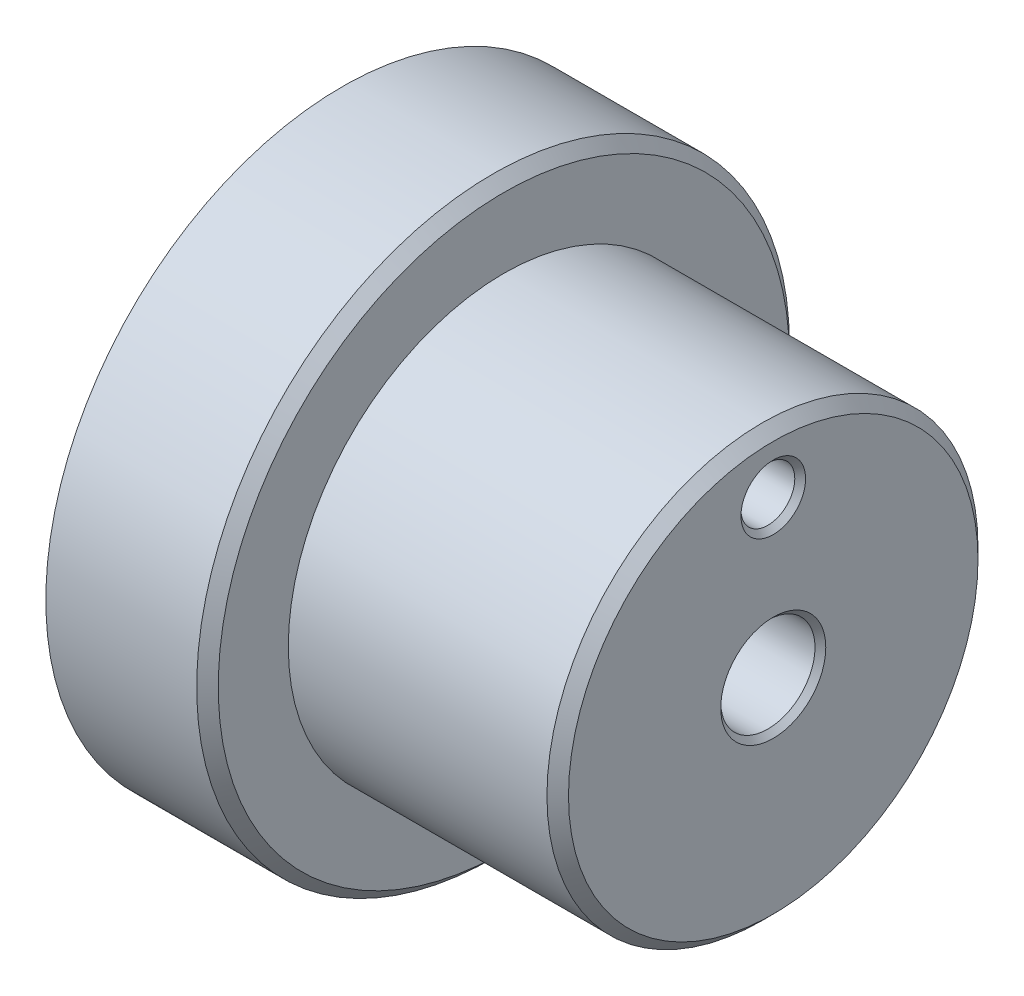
ISO-10303-21;
HEADER;
FILE_DESCRIPTION(('STEP AP214'),'2;1');
FILE_NAME('part.step','',(''),(''),'','','');
FILE_SCHEMA(('AUTOMOTIVE_DESIGN { 1 0 10303 214 1 1 1 1 }'));
ENDSEC;
DATA;
#1=APPLICATION_CONTEXT('core data for automotive mechanical design processes');
#2=APPLICATION_PROTOCOL_DEFINITION('international standard','automotive_design',2000,#1);
#3=PRODUCT_CONTEXT('',#1,'mechanical');
#4=PRODUCT('Part','Part','',(#3));
#5=PRODUCT_RELATED_PRODUCT_CATEGORY('part','',(#4));
#6=PRODUCT_DEFINITION_FORMATION('','',#4);
#7=PRODUCT_DEFINITION_CONTEXT('part definition',#1,'design');
#8=PRODUCT_DEFINITION('design','',#6,#7);
#9=PRODUCT_DEFINITION_SHAPE('','',#8);
#10=(LENGTH_UNIT() NAMED_UNIT(*) SI_UNIT(.MILLI.,.METRE.));
#11=(NAMED_UNIT(*) PLANE_ANGLE_UNIT() SI_UNIT($,.RADIAN.));
#12=(NAMED_UNIT(*) SI_UNIT($,.STERADIAN.) SOLID_ANGLE_UNIT());
#13=UNCERTAINTY_MEASURE_WITH_UNIT(LENGTH_MEASURE(1.E-05),#10,'distance_accuracy_value','');
#14=(GEOMETRIC_REPRESENTATION_CONTEXT(3) GLOBAL_UNCERTAINTY_ASSIGNED_CONTEXT((#13)) GLOBAL_UNIT_ASSIGNED_CONTEXT((#10,
#11,#12)) REPRESENTATION_CONTEXT('',''));
#15=CARTESIAN_POINT('',(0.,0.,0.));
#16=DIRECTION('',(0.,0.,1.));
#17=DIRECTION('',(1.,0.,0.));
#18=AXIS2_PLACEMENT_3D('',#15,#16,#17);
#19=CARTESIAN_POINT('',(0.,0.,0.));
#20=DIRECTION('',(1.,0.,0.));
#21=DIRECTION('',(0.,0.,-1.));
#22=AXIS2_PLACEMENT_3D('',#19,#20,#21);
#23=CYLINDRICAL_SURFACE('',#22,55.);
#24=CARTESIAN_POINT('',(-19.2933837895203,0.,0.));
#25=DIRECTION('',(1.,0.,0.));
#26=DIRECTION('',(0.,0.,-1.));
#27=AXIS2_PLACEMENT_3D('',#24,#25,#26);
#28=CIRCLE('',#27,55.);
#29=CARTESIAN_POINT('',(-19.2933837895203,0.,-55.));
#30=VERTEX_POINT('',#29);
#31=EDGE_CURVE('E140',#30,#30,#28,.F.);
#32=ORIENTED_EDGE('',*,*,#31,.T.);
#33=EDGE_LOOP('',(#32));
#34=FACE_BOUND('',#33,.T.);
#35=CARTESIAN_POINT('',(-47.2933837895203,0.,0.));
#36=DIRECTION('',(1.,0.,0.));
#37=DIRECTION('',(0.,0.,-1.));
#38=AXIS2_PLACEMENT_3D('',#35,#36,#37);
#39=CIRCLE('',#38,55.);
#40=CARTESIAN_POINT('',(-47.2933837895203,0.,-55.));
#41=VERTEX_POINT('',#40);
#42=EDGE_CURVE('E134',#41,#41,#39,.T.);
#43=ORIENTED_EDGE('',*,*,#42,.T.);
#44=EDGE_LOOP('',(#43));
#45=FACE_BOUND('',#44,.T.);
#46=ADVANCED_FACE('F40',(#34,#45),#23,.T.);
#47=CARTESIAN_POINT('',(-47.2933837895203,55.,0.));
#48=DIRECTION('',(-1.,0.,0.));
#49=DIRECTION('',(0.,0.,1.));
#50=AXIS2_PLACEMENT_3D('',#47,#48,#49);
#51=PLANE('',#50);
#52=CARTESIAN_POINT('',(-47.2933837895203,0.,0.));
#53=DIRECTION('',(-1.,0.,0.));
#54=DIRECTION('',(0.,0.,1.));
#55=AXIS2_PLACEMENT_3D('',#52,#53,#54);
#56=CIRCLE('',#55,46.);
#57=CARTESIAN_POINT('',(-47.2933837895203,0.,46.));
#58=VERTEX_POINT('',#57);
#59=EDGE_CURVE('E149',#58,#58,#56,.F.);
#60=ORIENTED_EDGE('',*,*,#59,.T.);
#61=EDGE_LOOP('',(#60));
#62=FACE_BOUND('',#61,.T.);
#63=ORIENTED_EDGE('',*,*,#42,.F.);
#64=EDGE_LOOP('',(#63));
#65=FACE_BOUND('',#64,.T.);
#66=ADVANCED_FACE('F221',(#62,#65),#51,.T.);
#67=CARTESIAN_POINT('',(0.,0.,0.));
#68=DIRECTION('',(1.,0.,0.));
#69=DIRECTION('',(0.,0.,-1.));
#70=AXIS2_PLACEMENT_3D('',#67,#68,#69);
#71=CYLINDRICAL_SURFACE('',#70,45.);
#72=CARTESIAN_POINT('',(-38.2933837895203,0.,0.));
#73=DIRECTION('',(-1.,0.,0.));
#74=DIRECTION('',(0.,0.,1.));
#75=AXIS2_PLACEMENT_3D('',#72,#73,#74);
#76=CIRCLE('',#75,45.);
#77=CARTESIAN_POINT('',(-38.2933837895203,0.,45.));
#78=VERTEX_POINT('',#77);
#79=EDGE_CURVE('E155',#78,#78,#76,.F.);
#80=ORIENTED_EDGE('',*,*,#79,.T.);
#81=EDGE_LOOP('',(#80));
#82=FACE_BOUND('',#81,.T.);
#83=CARTESIAN_POINT('',(-46.2933837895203,0.,0.));
#84=DIRECTION('',(-1.,0.,0.));
#85=DIRECTION('',(0.,0.,1.));
#86=AXIS2_PLACEMENT_3D('',#83,#84,#85);
#87=CIRCLE('',#86,45.);
#88=CARTESIAN_POINT('',(-46.2933837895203,0.,45.));
#89=VERTEX_POINT('',#88);
#90=EDGE_CURVE('E152',#89,#89,#87,.T.);
#91=ORIENTED_EDGE('',*,*,#90,.T.);
#92=EDGE_LOOP('',(#91));
#93=FACE_BOUND('',#92,.T.);
#94=ADVANCED_FACE('F227',(#82,#93),#71,.F.);
#95=CARTESIAN_POINT('',(-37.2933837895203,45.,0.));
#96=DIRECTION('',(-1.,0.,0.));
#97=DIRECTION('',(0.,0.,1.));
#98=AXIS2_PLACEMENT_3D('',#95,#96,#97);
#99=PLANE('',#98);
#100=CARTESIAN_POINT('',(-37.2933837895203,0.,0.));
#101=DIRECTION('',(-1.,0.,0.));
#102=DIRECTION('',(0.,0.,1.));
#103=AXIS2_PLACEMENT_3D('',#100,#101,#102);
#104=CIRCLE('',#103,9.75000000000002);
#105=CARTESIAN_POINT('',(-37.2933837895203,0.,9.75000000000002));
#106=VERTEX_POINT('',#105);
#107=EDGE_CURVE('E167',#106,#106,#104,.F.);
#108=ORIENTED_EDGE('',*,*,#107,.T.);
#109=EDGE_LOOP('',(#108));
#110=FACE_BOUND('',#109,.T.);
#111=CARTESIAN_POINT('',(-37.2933837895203,0.,0.));
#112=DIRECTION('',(-1.,0.,0.));
#113=DIRECTION('',(0.,0.,1.));
#114=AXIS2_PLACEMENT_3D('',#111,#112,#113);
#115=CIRCLE('',#114,44.);
#116=CARTESIAN_POINT('',(-37.2933837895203,0.,44.));
#117=VERTEX_POINT('',#116);
#118=EDGE_CURVE('E158',#117,#117,#115,.T.);
#119=ORIENTED_EDGE('',*,*,#118,.T.);
#120=EDGE_LOOP('',(#119));
#121=FACE_BOUND('',#120,.T.);
#122=ADVANCED_FACE('F264',(#110,#121),#99,.T.);
#123=CARTESIAN_POINT('',(32.7066162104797,0.,0.));
#124=DIRECTION('',(1.,0.,0.));
#125=DIRECTION('',(0.,0.,-1.));
#126=AXIS2_PLACEMENT_3D('',#123,#124,#125);
#127=PLANE('',#126);
#128=CARTESIAN_POINT('',(32.7066162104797,29.,0.));
#129=DIRECTION('',(1.,0.,0.));
#130=DIRECTION('',(0.,0.,-1.));
#131=AXIS2_PLACEMENT_3D('',#128,#129,#130);
#132=CIRCLE('',#131,5.99999999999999);
#133=CARTESIAN_POINT('',(32.7066162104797,29.,-5.99999999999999));
#134=VERTEX_POINT('',#133);
#135=EDGE_CURVE('E11',#134,#134,#132,.F.);
#136=ORIENTED_EDGE('',*,*,#135,.T.);
#137=EDGE_LOOP('',(#136));
#138=FACE_BOUND('',#137,.T.);
#139=CARTESIAN_POINT('',(32.7066162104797,0.,0.));
#140=DIRECTION('',(1.,0.,0.));
#141=DIRECTION('',(0.,0.,-1.));
#142=AXIS2_PLACEMENT_3D('',#139,#140,#141);
#143=CIRCLE('',#142,9.74999999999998);
#144=CARTESIAN_POINT('',(32.7066162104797,0.,-9.74999999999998));
#145=VERTEX_POINT('',#144);
#146=EDGE_CURVE('E170',#145,#145,#143,.F.);
#147=ORIENTED_EDGE('',*,*,#146,.T.);
#148=EDGE_LOOP('',(#147));
#149=FACE_BOUND('',#148,.T.);
#150=CARTESIAN_POINT('',(32.7066162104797,0.,0.));
#151=DIRECTION('',(1.,0.,0.));
#152=DIRECTION('',(0.,0.,-1.));
#153=AXIS2_PLACEMENT_3D('',#150,#151,#152);
#154=CIRCLE('',#153,38.);
#155=CARTESIAN_POINT('',(32.7066162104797,0.,-38.));
#156=VERTEX_POINT('',#155);
#157=EDGE_CURVE('E143',#156,#156,#154,.T.);
#158=ORIENTED_EDGE('',*,*,#157,.T.);
#159=EDGE_LOOP('',(#158));
#160=FACE_BOUND('',#159,.T.);
#161=ADVANCED_FACE('F261',(#138,#149,#160),#127,.T.);
#162=CARTESIAN_POINT('',(0.,0.,0.));
#163=DIRECTION('',(1.,0.,0.));
#164=DIRECTION('',(0.,0.,-1.));
#165=AXIS2_PLACEMENT_3D('',#162,#163,#164);
#166=CYLINDRICAL_SURFACE('',#165,40.);
#167=CARTESIAN_POINT('',(-5.29338378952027,-39.1918358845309,8.));
#168=CARTESIAN_POINT('',(-5.51598431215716,-39.1918159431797,8.00002666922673));
#169=CARTESIAN_POINT('',(-5.73857793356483,-39.1937316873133,7.99071035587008));
#170=CARTESIAN_POINT('',(-6.18212753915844,-39.2012897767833,7.95358673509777));
#171=CARTESIAN_POINT('',(-6.40308372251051,-39.2069316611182,7.92578171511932));
#172=CARTESIAN_POINT('',(-6.84145708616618,-39.2217860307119,7.85193172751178));
#173=CARTESIAN_POINT('',(-7.05887913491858,-39.2309930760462,7.80591454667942));
#174=CARTESIAN_POINT('',(-7.48898923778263,-39.2527015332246,7.69601051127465));
#175=CARTESIAN_POINT('',(-7.70167727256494,-39.2652029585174,7.63212358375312));
#176=CARTESIAN_POINT('',(-8.12081652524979,-39.2931373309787,7.48697595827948));
#177=CARTESIAN_POINT('',(-8.32726832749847,-39.3085700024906,7.40571689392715));
#178=CARTESIAN_POINT('',(-8.73262031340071,-39.3419309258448,7.22639517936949));
#179=CARTESIAN_POINT('',(-8.93151766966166,-39.359860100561,7.12832631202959));
#180=CARTESIAN_POINT('',(-9.32029083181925,-39.3976973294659,6.91614404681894));
#181=CARTESIAN_POINT('',(-9.51016909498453,-39.4176048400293,6.80203505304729));
#182=CARTESIAN_POINT('',(-9.87977120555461,-39.4588545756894,6.55850947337));
#183=CARTESIAN_POINT('',(-10.0594914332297,-39.4801973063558,6.42908748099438));
#184=CARTESIAN_POINT('',(-10.4096845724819,-39.5239924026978,6.15415578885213));
#185=CARTESIAN_POINT('',(-10.5800152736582,-39.5464552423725,6.00846658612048));
#186=CARTESIAN_POINT('',(-10.9078420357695,-39.5916124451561,5.70333270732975));
#187=CARTESIAN_POINT('',(-11.0653380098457,-39.6143068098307,5.54388793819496));
#188=CARTESIAN_POINT('',(-11.366476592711,-39.6593025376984,5.21226662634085));
#189=CARTESIAN_POINT('',(-11.5101147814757,-39.6816037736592,5.04008605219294));
#190=CARTESIAN_POINT('',(-11.7824473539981,-39.7251794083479,4.68425375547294));
#191=CARTESIAN_POINT('',(-11.9111465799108,-39.7464541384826,4.500605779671));
#192=CARTESIAN_POINT('',(-12.1538255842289,-39.7875762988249,4.12134325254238));
#193=CARTESIAN_POINT('',(-12.267664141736,-39.8074093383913,3.92563673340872));
#194=CARTESIAN_POINT('',(-12.4784214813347,-39.8448742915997,3.52511574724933));
#195=CARTESIAN_POINT('',(-12.5753405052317,-39.8625062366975,3.32030141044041));
#196=CARTESIAN_POINT('',(-12.7515146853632,-39.8950650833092,2.90302705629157));
#197=CARTESIAN_POINT('',(-12.8307717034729,-39.9099922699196,2.69056784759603));
#198=CARTESIAN_POINT('',(-12.9710109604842,-39.9367151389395,2.25951457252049));
#199=CARTESIAN_POINT('',(-13.0319938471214,-39.948510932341,2.04092072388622));
#200=CARTESIAN_POINT('',(-13.1345274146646,-39.9685005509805,1.60205660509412));
#201=CARTESIAN_POINT('',(-13.1763198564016,-39.9767391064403,1.38184484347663));
#202=CARTESIAN_POINT('',(-13.2412789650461,-39.9895989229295,0.938668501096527));
#203=CARTESIAN_POINT('',(-13.2644525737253,-39.9942215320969,0.715704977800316));
#204=CARTESIAN_POINT('',(-13.2920128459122,-39.9997235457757,0.268546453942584));
#205=CARTESIAN_POINT('',(-13.2963972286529,-40.0006024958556,0.0443513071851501));
#206=CARTESIAN_POINT('',(-13.2863367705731,-39.9985908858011,-0.40359813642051));
#207=CARTESIAN_POINT('',(-13.2718920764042,-39.9957003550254,-0.627352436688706));
#208=CARTESIAN_POINT('',(-13.2246365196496,-39.9863007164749,-1.0695608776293));
#209=CARTESIAN_POINT('',(-13.1920940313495,-39.9798444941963,-1.28804488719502));
#210=CARTESIAN_POINT('',(-13.1090768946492,-39.9635259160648,-1.72152774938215));
#211=CARTESIAN_POINT('',(-13.0585960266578,-39.9536623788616,-1.93652536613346));
#212=CARTESIAN_POINT('',(-12.9401132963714,-39.9308038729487,-2.36138711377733));
#213=CARTESIAN_POINT('',(-12.8721172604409,-39.9178099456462,-2.57125292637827));
#214=CARTESIAN_POINT('',(-12.7190809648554,-39.8890377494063,-2.98456033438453));
#215=CARTESIAN_POINT('',(-12.6340346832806,-39.8732584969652,-3.18799963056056));
#216=CARTESIAN_POINT('',(-12.4469628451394,-39.839241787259,-3.58823088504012));
#217=CARTESIAN_POINT('',(-12.3448363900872,-39.8209898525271,-3.7849744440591));
#218=CARTESIAN_POINT('',(-12.1247070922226,-39.7825996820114,-4.16917750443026));
#219=CARTESIAN_POINT('',(-12.006704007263,-39.7624614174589,-4.35663686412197));
#220=CARTESIAN_POINT('',(-11.7556183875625,-39.7208402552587,-4.72106963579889));
#221=CARTESIAN_POINT('',(-11.6225325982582,-39.6993570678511,-4.89804077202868));
#222=CARTESIAN_POINT('',(-11.3422509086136,-39.6556382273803,-5.24023924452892));
#223=CARTESIAN_POINT('',(-11.1950593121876,-39.6334028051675,-5.4054701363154));
#224=CARTESIAN_POINT('',(-10.8848165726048,-39.5883841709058,-5.72594829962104));
#225=CARTESIAN_POINT('',(-10.7215329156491,-39.5655981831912,-5.88097018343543));
#226=CARTESIAN_POINT('',(-10.3824491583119,-39.52050553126,-6.1767327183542));
#227=CARTESIAN_POINT('',(-10.2066492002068,-39.4981988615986,-6.31747353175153));
#228=CARTESIAN_POINT('',(-9.84366593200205,-39.4546904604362,-6.58373833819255));
#229=CARTESIAN_POINT('',(-9.65647915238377,-39.4334890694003,-6.70925765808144));
#230=CARTESIAN_POINT('',(-9.27205115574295,-39.3928073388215,-6.94413000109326));
#231=CARTESIAN_POINT('',(-9.07481020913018,-39.3733269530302,-7.05348345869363));
#232=CARTESIAN_POINT('',(-8.67103742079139,-39.3365988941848,-7.25551976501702));
#233=CARTESIAN_POINT('',(-8.46448007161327,-39.319357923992,-7.34815287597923));
#234=CARTESIAN_POINT('',(-8.04415081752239,-39.287693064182,-7.51561296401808));
#235=CARTESIAN_POINT('',(-7.83038176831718,-39.2732680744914,-7.59044689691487));
#236=CARTESIAN_POINT('',(-7.39731939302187,-39.2476734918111,-7.72169650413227));
#237=CARTESIAN_POINT('',(-7.17803208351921,-39.2365005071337,-7.77813137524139));
#238=CARTESIAN_POINT('',(-6.73540374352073,-39.217732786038,-7.8722129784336));
#239=CARTESIAN_POINT('',(-6.5120646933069,-39.2101363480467,-7.90986864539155));
#240=CARTESIAN_POINT('',(-6.1225690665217,-39.200259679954,-7.95864886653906));
#241=CARTESIAN_POINT('',(-5.95697056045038,-39.1971035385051,-7.97416273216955));
#242=CARTESIAN_POINT('',(-5.62538102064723,-39.192890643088,-7.99483261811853));
#243=CARTESIAN_POINT('',(-5.45939111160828,-39.1918303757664,-8.00000597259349));
#244=CARTESIAN_POINT('',(-5.29338378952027,-39.1918358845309,-8.));
#245=B_SPLINE_CURVE_WITH_KNOTS('',3,(#167,#168,#169,#170,#171,#172,#173,#174,#175,#176,#177,
#178,#179,#180,#181,#182,#183,#184,#185,#186,#187,#188,#189,#190,#191,#192,#193,#194,#195,#196,
#197,#198,#199,#200,#201,#202,#203,#204,#205,#206,#207,#208,#209,#210,#211,#212,#213,#214,#215,
#216,#217,#218,#219,#220,#221,#222,#223,#224,#225,#226,#227,#228,#229,#230,#231,#232,#233,#234,
#235,#236,#237,#238,#239,#240,#241,#242,#243,#244),.UNSPECIFIED.,.F.,.F.,(4,2,2,2,2,2,2,2,2,2,2,
2,2,2,2,2,2,2,2,2,2,2,2,2,2,2,2,2,2,2,2,2,2,2,2,2,2,2,4),(0.,0.667588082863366,1.33509358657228,
2.00158456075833,2.66807825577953,3.33450930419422,4.00118736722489,4.66768273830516,
5.33441413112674,6.00940860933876,6.68440765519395,7.35962128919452,8.0346154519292,
8.71561799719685,9.39661080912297,10.0775317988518,10.7584286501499,11.4304948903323,
12.1023104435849,12.7742075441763,13.4460994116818,14.1082836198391,14.7706976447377,
15.4328916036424,16.0953198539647,16.7618092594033,17.4283088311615,18.0949524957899,
18.761393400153,19.439500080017,20.1175990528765,20.7959056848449,21.4741940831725,
22.1544680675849,22.8344757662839,23.5137716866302,24.1927440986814,24.6914848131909,
25.1893887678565),.UNSPECIFIED.);
#246=CARTESIAN_POINT('',(-5.29338378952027,-39.1918358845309,8.));
#247=VERTEX_POINT('',#246);
#248=CARTESIAN_POINT('',(-5.29338378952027,-39.1918358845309,-8.));
#249=VERTEX_POINT('',#248);
#250=EDGE_CURVE('E63',#247,#249,#245,.T.);
#251=ORIENTED_EDGE('',*,*,#250,.F.);
#252=DIRECTION('',(1.,0.,0.));
#253=VECTOR('',#252,1.);
#254=CARTESIAN_POINT('',(0.,-39.1918358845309,8.));
#255=LINE('',#254,#253);
#256=CARTESIAN_POINT('',(18.7066162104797,-39.1918358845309,8.));
#257=VERTEX_POINT('',#256);
#258=EDGE_CURVE('E173',#257,#247,#255,.F.);
#259=ORIENTED_EDGE('',*,*,#258,.F.);
#260=CARTESIAN_POINT('',(18.7066162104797,-39.1918358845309,-8.));
#261=CARTESIAN_POINT('',(18.9292167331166,-39.1918159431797,-8.00002666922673));
#262=CARTESIAN_POINT('',(19.1518103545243,-39.1937316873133,-7.99071035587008));
#263=CARTESIAN_POINT('',(19.5953599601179,-39.2012897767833,-7.95358673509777));
#264=CARTESIAN_POINT('',(19.81631614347,-39.2069316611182,-7.92578171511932));
#265=CARTESIAN_POINT('',(20.2546895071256,-39.2217860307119,-7.85193172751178));
#266=CARTESIAN_POINT('',(20.472111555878,-39.2309930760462,-7.80591454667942));
#267=CARTESIAN_POINT('',(20.9022216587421,-39.2527015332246,-7.69601051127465));
#268=CARTESIAN_POINT('',(21.1149096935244,-39.2652029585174,-7.63212358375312));
#269=CARTESIAN_POINT('',(21.5340489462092,-39.2931373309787,-7.48697595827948));
#270=CARTESIAN_POINT('',(21.7405007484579,-39.3085700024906,-7.40571689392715));
#271=CARTESIAN_POINT('',(22.1458527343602,-39.3419309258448,-7.22639517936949));
#272=CARTESIAN_POINT('',(22.3447500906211,-39.359860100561,-7.12832631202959));
#273=CARTESIAN_POINT('',(22.7335232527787,-39.3976973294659,-6.91614404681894));
#274=CARTESIAN_POINT('',(22.923401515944,-39.4176048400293,-6.80203505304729));
#275=CARTESIAN_POINT('',(23.2930036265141,-39.4588545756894,-6.55850947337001));
#276=CARTESIAN_POINT('',(23.4727238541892,-39.4801973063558,-6.42908748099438));
#277=CARTESIAN_POINT('',(23.8229169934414,-39.5239924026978,-6.15415578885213));
#278=CARTESIAN_POINT('',(23.9932476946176,-39.5464552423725,-6.00846658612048));
#279=CARTESIAN_POINT('',(24.321074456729,-39.5916124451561,-5.70333270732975));
#280=CARTESIAN_POINT('',(24.4785704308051,-39.6143068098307,-5.54388793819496));
#281=CARTESIAN_POINT('',(24.7797090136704,-39.6593025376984,-5.21226662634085));
#282=CARTESIAN_POINT('',(24.9233472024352,-39.6816037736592,-5.04008605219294));
#283=CARTESIAN_POINT('',(25.1956797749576,-39.7251794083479,-4.68425375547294));
#284=CARTESIAN_POINT('',(25.3243790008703,-39.7464541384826,-4.500605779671));
#285=CARTESIAN_POINT('',(25.5670580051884,-39.7875762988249,-4.12134325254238));
#286=CARTESIAN_POINT('',(25.6808965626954,-39.8074093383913,-3.92563673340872));
#287=CARTESIAN_POINT('',(25.8916539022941,-39.8448742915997,-3.52511574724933));
#288=CARTESIAN_POINT('',(25.9885729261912,-39.8625062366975,-3.32030141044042));
#289=CARTESIAN_POINT('',(26.1647471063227,-39.8950650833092,-2.90302705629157));
#290=CARTESIAN_POINT('',(26.2440041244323,-39.9099922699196,-2.69056784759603));
#291=CARTESIAN_POINT('',(26.3842433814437,-39.9367151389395,-2.25951457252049));
#292=CARTESIAN_POINT('',(26.4452262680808,-39.948510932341,-2.04092072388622));
#293=CARTESIAN_POINT('',(26.547759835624,-39.9685005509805,-1.60205660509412));
#294=CARTESIAN_POINT('',(26.589552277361,-39.9767391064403,-1.38184484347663));
#295=CARTESIAN_POINT('',(26.6545113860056,-39.9895989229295,-0.938668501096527));
#296=CARTESIAN_POINT('',(26.6776849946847,-39.9942215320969,-0.715704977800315));
#297=CARTESIAN_POINT('',(26.7052452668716,-39.9997235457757,-0.268546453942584));
#298=CARTESIAN_POINT('',(26.7096296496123,-40.0006024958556,-0.0443513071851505));
#299=CARTESIAN_POINT('',(26.6995691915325,-39.9985908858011,0.403598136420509));
#300=CARTESIAN_POINT('',(26.6851244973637,-39.9957003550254,0.627352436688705));
#301=CARTESIAN_POINT('',(26.6378689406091,-39.9863007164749,1.0695608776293));
#302=CARTESIAN_POINT('',(26.605326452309,-39.9798444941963,1.28804488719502));
#303=CARTESIAN_POINT('',(26.5223093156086,-39.9635259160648,1.72152774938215));
#304=CARTESIAN_POINT('',(26.4718284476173,-39.9536623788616,1.93652536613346));
#305=CARTESIAN_POINT('',(26.3533457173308,-39.9308038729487,2.36138711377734));
#306=CARTESIAN_POINT('',(26.2853496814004,-39.9178099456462,2.57125292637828));
#307=CARTESIAN_POINT('',(26.1323133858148,-39.8890377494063,2.98456033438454));
#308=CARTESIAN_POINT('',(26.0472671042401,-39.8732584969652,3.18799963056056));
#309=CARTESIAN_POINT('',(25.8601952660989,-39.839241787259,3.58823088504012));
#310=CARTESIAN_POINT('',(25.7580688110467,-39.8209898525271,3.7849744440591));
#311=CARTESIAN_POINT('',(25.5379395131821,-39.7825996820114,4.16917750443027));
#312=CARTESIAN_POINT('',(25.4199364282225,-39.7624614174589,4.35663686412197));
#313=CARTESIAN_POINT('',(25.168850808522,-39.7208402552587,4.7210696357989));
#314=CARTESIAN_POINT('',(25.0357650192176,-39.6993570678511,4.89804077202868));
#315=CARTESIAN_POINT('',(24.755483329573,-39.6556382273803,5.24023924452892));
#316=CARTESIAN_POINT('',(24.6082917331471,-39.6334028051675,5.40547013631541));
#317=CARTESIAN_POINT('',(24.2980489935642,-39.5883841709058,5.72594829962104));
#318=CARTESIAN_POINT('',(24.1347653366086,-39.5655981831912,5.88097018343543));
#319=CARTESIAN_POINT('',(23.7956815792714,-39.52050553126,6.1767327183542));
#320=CARTESIAN_POINT('',(23.6198816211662,-39.4981988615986,6.31747353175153));
#321=CARTESIAN_POINT('',(23.2568983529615,-39.4546904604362,6.58373833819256));
#322=CARTESIAN_POINT('',(23.0697115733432,-39.4334890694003,6.70925765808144));
#323=CARTESIAN_POINT('',(22.6852835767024,-39.3928073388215,6.94413000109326));
#324=CARTESIAN_POINT('',(22.4880426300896,-39.3733269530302,7.05348345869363));
#325=CARTESIAN_POINT('',(22.0842698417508,-39.3365988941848,7.25551976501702));
#326=CARTESIAN_POINT('',(21.8777124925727,-39.319357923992,7.34815287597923));
#327=CARTESIAN_POINT('',(21.4573832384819,-39.287693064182,7.51561296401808));
#328=CARTESIAN_POINT('',(21.2436141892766,-39.2732680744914,7.59044689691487));
#329=CARTESIAN_POINT('',(20.8105518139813,-39.2476734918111,7.72169650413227));
#330=CARTESIAN_POINT('',(20.5912645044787,-39.2365005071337,7.77813137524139));
#331=CARTESIAN_POINT('',(20.1486361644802,-39.217732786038,7.8722129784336));
#332=CARTESIAN_POINT('',(19.9252971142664,-39.2101363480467,7.90986864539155));
#333=CARTESIAN_POINT('',(19.5358014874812,-39.200259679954,7.95864886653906));
#334=CARTESIAN_POINT('',(19.3702029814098,-39.1971035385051,7.97416273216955));
#335=CARTESIAN_POINT('',(19.0386134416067,-39.192890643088,7.99483261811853));
#336=CARTESIAN_POINT('',(18.8726235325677,-39.1918303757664,8.00000597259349));
#337=CARTESIAN_POINT('',(18.7066162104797,-39.1918358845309,8.));
#338=B_SPLINE_CURVE_WITH_KNOTS('',3,(#260,#261,#262,#263,#264,#265,#266,#267,#268,#269,#270,
#271,#272,#273,#274,#275,#276,#277,#278,#279,#280,#281,#282,#283,#284,#285,#286,#287,#288,#289,
#290,#291,#292,#293,#294,#295,#296,#297,#298,#299,#300,#301,#302,#303,#304,#305,#306,#307,#308,
#309,#310,#311,#312,#313,#314,#315,#316,#317,#318,#319,#320,#321,#322,#323,#324,#325,#326,#327,
#328,#329,#330,#331,#332,#333,#334,#335,#336,#337),.UNSPECIFIED.,.F.,.F.,(4,2,2,2,2,2,2,2,2,2,2,
2,2,2,2,2,2,2,2,2,2,2,2,2,2,2,2,2,2,2,2,2,2,2,2,2,2,2,4),(0.,0.66758808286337,1.33509358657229,
2.00158456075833,2.66807825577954,3.33450930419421,4.00118736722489,4.66768273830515,
5.33441413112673,6.00940860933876,6.68440765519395,7.35962128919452,8.0346154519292,
8.71561799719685,9.39661080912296,10.0775317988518,10.7584286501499,11.4304948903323,
12.1023104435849,12.7742075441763,13.4460994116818,14.1082836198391,14.7706976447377,
15.4328916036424,16.0953198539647,16.7618092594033,17.4283088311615,18.0949524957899,
18.761393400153,19.439500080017,20.1175990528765,20.7959056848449,21.4741940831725,
22.1544680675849,22.8344757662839,23.5137716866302,24.1927440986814,24.6914848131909,
25.1893887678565),.UNSPECIFIED.);
#339=CARTESIAN_POINT('',(18.7066162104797,-39.1918358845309,-8.));
#340=VERTEX_POINT('',#339);
#341=EDGE_CURVE('E175',#340,#257,#338,.T.);
#342=ORIENTED_EDGE('',*,*,#341,.F.);
#343=DIRECTION('',(1.,0.,0.));
#344=VECTOR('',#343,1.);
#345=CARTESIAN_POINT('',(0.,-39.1918358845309,-8.));
#346=LINE('',#345,#344);
#347=EDGE_CURVE('E182',#249,#340,#346,.T.);
#348=ORIENTED_EDGE('',*,*,#347,.F.);
#349=EDGE_LOOP('',(#251,#259,#342,#348));
#350=FACE_BOUND('',#349,.T.);
#351=CARTESIAN_POINT('',(30.7066162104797,0.,0.));
#352=DIRECTION('',(1.,0.,0.));
#353=DIRECTION('',(0.,0.,-1.));
#354=AXIS2_PLACEMENT_3D('',#351,#352,#353);
#355=CIRCLE('',#354,40.);
#356=CARTESIAN_POINT('',(30.7066162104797,0.,-40.));
#357=VERTEX_POINT('',#356);
#358=EDGE_CURVE('E146',#357,#357,#355,.F.);
#359=ORIENTED_EDGE('',*,*,#358,.T.);
#360=EDGE_LOOP('',(#359));
#361=FACE_BOUND('',#360,.T.);
#362=CARTESIAN_POINT('',(-17.2933837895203,0.,0.));
#363=DIRECTION('',(1.,0.,0.));
#364=DIRECTION('',(0.,0.,-1.));
#365=AXIS2_PLACEMENT_3D('',#362,#363,#364);
#366=CIRCLE('',#365,40.);
#367=CARTESIAN_POINT('',(-17.2933837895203,0.,-40.));
#368=VERTEX_POINT('',#367);
#369=EDGE_CURVE('E127',#368,#368,#366,.T.);
#370=ORIENTED_EDGE('',*,*,#369,.T.);
#371=EDGE_LOOP('',(#370));
#372=FACE_BOUND('',#371,.T.);
#373=ADVANCED_FACE('F184',(#350,#361,#372),#166,.T.);
#374=CARTESIAN_POINT('',(-17.2933837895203,40.,0.));
#375=DIRECTION('',(1.,0.,0.));
#376=DIRECTION('',(0.,0.,-1.));
#377=AXIS2_PLACEMENT_3D('',#374,#375,#376);
#378=PLANE('',#377);
#379=CARTESIAN_POINT('',(-17.2933837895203,0.,0.));
#380=DIRECTION('',(1.,0.,0.));
#381=DIRECTION('',(0.,0.,-1.));
#382=AXIS2_PLACEMENT_3D('',#379,#380,#381);
#383=CIRCLE('',#382,53.);
#384=CARTESIAN_POINT('',(-17.2933837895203,0.,-53.));
#385=VERTEX_POINT('',#384);
#386=EDGE_CURVE('E137',#385,#385,#383,.T.);
#387=ORIENTED_EDGE('',*,*,#386,.T.);
#388=EDGE_LOOP('',(#387));
#389=FACE_BOUND('',#388,.T.);
#390=ORIENTED_EDGE('',*,*,#369,.F.);
#391=EDGE_LOOP('',(#390));
#392=FACE_BOUND('',#391,.T.);
#393=ADVANCED_FACE('F237',(#389,#392),#378,.T.);
#394=CARTESIAN_POINT('',(-17.2933837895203,0.,0.));
#395=DIRECTION('',(-1.,0.,0.));
#396=DIRECTION('',(0.,0.,1.));
#397=AXIS2_PLACEMENT_3D('',#394,#395,#396);
#398=CONICAL_SURFACE('',#397,53.,0.785398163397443);
#399=ORIENTED_EDGE('',*,*,#31,.F.);
#400=EDGE_LOOP('',(#399));
#401=FACE_BOUND('',#400,.T.);
#402=ORIENTED_EDGE('',*,*,#386,.F.);
#403=EDGE_LOOP('',(#402));
#404=FACE_BOUND('',#403,.T.);
#405=ADVANCED_FACE('F233',(#401,#404),#398,.T.);
#406=CARTESIAN_POINT('',(32.7066162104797,0.,0.));
#407=DIRECTION('',(-1.,0.,0.));
#408=DIRECTION('',(0.,0.,1.));
#409=AXIS2_PLACEMENT_3D('',#406,#407,#408);
#410=CONICAL_SURFACE('',#409,38.,0.785398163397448);
#411=ORIENTED_EDGE('',*,*,#358,.F.);
#412=EDGE_LOOP('',(#411));
#413=FACE_BOUND('',#412,.T.);
#414=ORIENTED_EDGE('',*,*,#157,.F.);
#415=EDGE_LOOP('',(#414));
#416=FACE_BOUND('',#415,.T.);
#417=ADVANCED_FACE('F236',(#413,#416),#410,.T.);
#418=CARTESIAN_POINT('',(-47.2933837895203,0.,0.));
#419=DIRECTION('',(-1.,0.,0.));
#420=DIRECTION('',(0.,0.,1.));
#421=AXIS2_PLACEMENT_3D('',#418,#419,#420);
#422=CONICAL_SURFACE('',#421,46.,0.785398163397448);
#423=ORIENTED_EDGE('',*,*,#90,.F.);
#424=EDGE_LOOP('',(#423));
#425=FACE_BOUND('',#424,.T.);
#426=ORIENTED_EDGE('',*,*,#59,.F.);
#427=EDGE_LOOP('',(#426));
#428=FACE_BOUND('',#427,.T.);
#429=ADVANCED_FACE('F241',(#425,#428),#422,.F.);
#430=CARTESIAN_POINT('',(-38.2933837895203,0.,0.));
#431=DIRECTION('',(-1.,0.,0.));
#432=DIRECTION('',(0.,0.,1.));
#433=AXIS2_PLACEMENT_3D('',#430,#431,#432);
#434=TOROIDAL_SURFACE('',#433,44.,1.);
#435=ORIENTED_EDGE('',*,*,#118,.F.);
#436=EDGE_LOOP('',(#435));
#437=FACE_BOUND('',#436,.T.);
#438=ORIENTED_EDGE('',*,*,#79,.F.);
#439=EDGE_LOOP('',(#438));
#440=FACE_BOUND('',#439,.T.);
#441=ADVANCED_FACE('F245',(#437,#440),#434,.F.);
#442=CARTESIAN_POINT('',(-37.2933837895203,0.,0.));
#443=DIRECTION('',(-1.,0.,0.));
#444=DIRECTION('',(0.,0.,1.));
#445=AXIS2_PLACEMENT_3D('',#442,#443,#444);
#446=CYLINDRICAL_SURFACE('',#445,8.74999999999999);
#447=CARTESIAN_POINT('',(-36.2933837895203,0.,0.));
#448=DIRECTION('',(-1.,0.,0.));
#449=DIRECTION('',(0.,0.,1.));
#450=AXIS2_PLACEMENT_3D('',#447,#448,#449);
#451=CIRCLE('',#450,8.74999999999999);
#452=CARTESIAN_POINT('',(-36.2933837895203,0.,8.74999999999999));
#453=VERTEX_POINT('',#452);
#454=EDGE_CURVE('E164',#453,#453,#451,.T.);
#455=ORIENTED_EDGE('',*,*,#454,.T.);
#456=EDGE_LOOP('',(#455));
#457=FACE_BOUND('',#456,.T.);
#458=CARTESIAN_POINT('',(31.7066162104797,0.,0.));
#459=DIRECTION('',(1.,0.,0.));
#460=DIRECTION('',(0.,0.,-1.));
#461=AXIS2_PLACEMENT_3D('',#458,#459,#460);
#462=CIRCLE('',#461,8.74999999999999);
#463=CARTESIAN_POINT('',(31.7066162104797,0.,-8.74999999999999));
#464=VERTEX_POINT('',#463);
#465=EDGE_CURVE('E161',#464,#464,#462,.T.);
#466=ORIENTED_EDGE('',*,*,#465,.T.);
#467=EDGE_LOOP('',(#466));
#468=FACE_BOUND('',#467,.T.);
#469=ADVANCED_FACE('F205',(#457,#468),#446,.F.);
#470=CARTESIAN_POINT('',(-36.2933837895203,0.,0.));
#471=DIRECTION('',(-1.,0.,0.));
#472=DIRECTION('',(0.,0.,1.));
#473=AXIS2_PLACEMENT_3D('',#470,#471,#472);
#474=CONICAL_SURFACE('',#473,8.74999999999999,0.785398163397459);
#475=ORIENTED_EDGE('',*,*,#107,.F.);
#476=EDGE_LOOP('',(#475));
#477=FACE_BOUND('',#476,.T.);
#478=ORIENTED_EDGE('',*,*,#454,.F.);
#479=EDGE_LOOP('',(#478));
#480=FACE_BOUND('',#479,.T.);
#481=ADVANCED_FACE('F250',(#477,#480),#474,.F.);
#482=CARTESIAN_POINT('',(32.7066162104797,0.,0.));
#483=DIRECTION('',(1.,0.,0.));
#484=DIRECTION('',(0.,0.,-1.));
#485=AXIS2_PLACEMENT_3D('',#482,#483,#484);
#486=CONICAL_SURFACE('',#485,9.74999999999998,0.785398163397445);
#487=ORIENTED_EDGE('',*,*,#465,.F.);
#488=EDGE_LOOP('',(#487));
#489=FACE_BOUND('',#488,.T.);
#490=ORIENTED_EDGE('',*,*,#146,.F.);
#491=EDGE_LOOP('',(#490));
#492=FACE_BOUND('',#491,.T.);
#493=ADVANCED_FACE('F204',(#489,#492),#486,.F.);
#494=CARTESIAN_POINT('',(-5.29338378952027,-55.,0.));
#495=DIRECTION('',(0.,1.,0.));
#496=DIRECTION('',(0.,0.,1.));
#497=AXIS2_PLACEMENT_3D('',#494,#495,#496);
#498=CYLINDRICAL_SURFACE('',#497,8.);
#499=ORIENTED_EDGE('',*,*,#250,.T.);
#500=DIRECTION('',(0.,1.,0.));
#501=VECTOR('',#500,1.);
#502=CARTESIAN_POINT('',(-5.29338378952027,-55.,-8.));
#503=LINE('',#502,#501);
#504=CARTESIAN_POINT('',(-5.29338378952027,-32.,-8.));
#505=VERTEX_POINT('',#504);
#506=EDGE_CURVE('E125',#249,#505,#503,.T.);
#507=ORIENTED_EDGE('',*,*,#506,.T.);
#508=CARTESIAN_POINT('',(-5.29338378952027,-32.,0.));
#509=DIRECTION('',(0.,1.,0.));
#510=DIRECTION('',(0.,0.,1.));
#511=AXIS2_PLACEMENT_3D('',#508,#509,#510);
#512=CIRCLE('',#511,8.);
#513=CARTESIAN_POINT('',(-5.29338378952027,-32.,8.));
#514=VERTEX_POINT('',#513);
#515=EDGE_CURVE('E113',#505,#514,#512,.T.);
#516=ORIENTED_EDGE('',*,*,#515,.T.);
#517=DIRECTION('',(0.,1.,0.));
#518=VECTOR('',#517,1.);
#519=CARTESIAN_POINT('',(-5.29338378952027,-55.,8.));
#520=LINE('',#519,#518);
#521=EDGE_CURVE('E124',#247,#514,#520,.T.);
#522=ORIENTED_EDGE('',*,*,#521,.F.);
#523=EDGE_LOOP('',(#499,#507,#516,#522));
#524=FACE_BOUND('',#523,.T.);
#525=ADVANCED_FACE('F200',(#524),#498,.F.);
#526=CARTESIAN_POINT('',(-5.29338378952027,-55.,-8.));
#527=DIRECTION('',(0.,0.,-1.));
#528=DIRECTION('',(-1.,0.,0.));
#529=AXIS2_PLACEMENT_3D('',#526,#527,#528);
#530=PLANE('',#529);
#531=ORIENTED_EDGE('',*,*,#347,.T.);
#532=DIRECTION('',(0.,1.,0.));
#533=VECTOR('',#532,1.);
#534=CARTESIAN_POINT('',(18.7066162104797,-55.,-8.));
#535=LINE('',#534,#533);
#536=CARTESIAN_POINT('',(18.7066162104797,-32.,-8.));
#537=VERTEX_POINT('',#536);
#538=EDGE_CURVE('E128',#340,#537,#535,.T.);
#539=ORIENTED_EDGE('',*,*,#538,.T.);
#540=DIRECTION('',(-1.,0.,0.));
#541=VECTOR('',#540,1.);
#542=CARTESIAN_POINT('',(-5.29338378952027,-32.,-8.));
#543=LINE('',#542,#541);
#544=EDGE_CURVE('E121',#537,#505,#543,.T.);
#545=ORIENTED_EDGE('',*,*,#544,.T.);
#546=ORIENTED_EDGE('',*,*,#506,.F.);
#547=EDGE_LOOP('',(#531,#539,#545,#546));
#548=FACE_BOUND('',#547,.T.);
#549=ADVANCED_FACE('F194',(#548),#530,.F.);
#550=CARTESIAN_POINT('',(18.7066162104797,-55.,0.));
#551=DIRECTION('',(0.,1.,0.));
#552=DIRECTION('',(0.,0.,1.));
#553=AXIS2_PLACEMENT_3D('',#550,#551,#552);
#554=CYLINDRICAL_SURFACE('',#553,8.);
#555=ORIENTED_EDGE('',*,*,#341,.T.);
#556=DIRECTION('',(0.,1.,0.));
#557=VECTOR('',#556,1.);
#558=CARTESIAN_POINT('',(18.7066162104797,-55.,8.));
#559=LINE('',#558,#557);
#560=CARTESIAN_POINT('',(18.7066162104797,-32.,8.));
#561=VERTEX_POINT('',#560);
#562=EDGE_CURVE('E55',#257,#561,#559,.T.);
#563=ORIENTED_EDGE('',*,*,#562,.T.);
#564=CARTESIAN_POINT('',(18.7066162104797,-32.,0.));
#565=DIRECTION('',(0.,1.,0.));
#566=DIRECTION('',(0.,0.,1.));
#567=AXIS2_PLACEMENT_3D('',#564,#565,#566);
#568=CIRCLE('',#567,8.);
#569=EDGE_CURVE('E118',#561,#537,#568,.T.);
#570=ORIENTED_EDGE('',*,*,#569,.T.);
#571=ORIENTED_EDGE('',*,*,#538,.F.);
#572=EDGE_LOOP('',(#555,#563,#570,#571));
#573=FACE_BOUND('',#572,.T.);
#574=ADVANCED_FACE('F188',(#573),#554,.F.);
#575=CARTESIAN_POINT('',(-5.29338378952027,-55.,8.));
#576=DIRECTION('',(0.,0.,1.));
#577=DIRECTION('',(1.,0.,0.));
#578=AXIS2_PLACEMENT_3D('',#575,#576,#577);
#579=PLANE('',#578);
#580=ORIENTED_EDGE('',*,*,#258,.T.);
#581=ORIENTED_EDGE('',*,*,#521,.T.);
#582=DIRECTION('',(1.,0.,0.));
#583=VECTOR('',#582,1.);
#584=CARTESIAN_POINT('',(-5.29338378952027,-32.,8.));
#585=LINE('',#584,#583);
#586=EDGE_CURVE('E116',#514,#561,#585,.T.);
#587=ORIENTED_EDGE('',*,*,#586,.T.);
#588=ORIENTED_EDGE('',*,*,#562,.F.);
#589=EDGE_LOOP('',(#580,#581,#587,#588));
#590=FACE_BOUND('',#589,.T.);
#591=ADVANCED_FACE('F193',(#590),#579,.F.);
#592=CARTESIAN_POINT('',(-5.29338378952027,-32.,0.));
#593=DIRECTION('',(0.,1.,0.));
#594=DIRECTION('',(0.,0.,1.));
#595=AXIS2_PLACEMENT_3D('',#592,#593,#594);
#596=PLANE('',#595);
#597=CARTESIAN_POINT('',(18.7066162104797,-32.,0.));
#598=DIRECTION('',(0.,-1.,0.));
#599=DIRECTION('',(0.,0.,-1.));
#600=AXIS2_PLACEMENT_3D('',#597,#598,#599);
#601=CIRCLE('',#600,1.24999999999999);
#602=CARTESIAN_POINT('',(18.7066162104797,-32.,-1.24999999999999));
#603=VERTEX_POINT('',#602);
#604=EDGE_CURVE('E99',#603,#603,#601,.T.);
#605=ORIENTED_EDGE('',*,*,#604,.F.);
#606=EDGE_LOOP('',(#605));
#607=FACE_BOUND('',#606,.T.);
#608=CARTESIAN_POINT('',(-5.29338378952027,-32.,0.));
#609=DIRECTION('',(0.,-1.,0.));
#610=DIRECTION('',(0.,0.,-1.));
#611=AXIS2_PLACEMENT_3D('',#608,#609,#610);
#612=CIRCLE('',#611,1.24999999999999);
#613=CARTESIAN_POINT('',(-5.29338378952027,-32.,-1.24999999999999));
#614=VERTEX_POINT('',#613);
#615=EDGE_CURVE('E107',#614,#614,#612,.T.);
#616=ORIENTED_EDGE('',*,*,#615,.F.);
#617=EDGE_LOOP('',(#616));
#618=FACE_BOUND('',#617,.T.);
#619=ORIENTED_EDGE('',*,*,#515,.F.);
#620=ORIENTED_EDGE('',*,*,#544,.F.);
#621=ORIENTED_EDGE('',*,*,#569,.F.);
#622=ORIENTED_EDGE('',*,*,#586,.F.);
#623=EDGE_LOOP('',(#619,#620,#621,#622));
#624=FACE_BOUND('',#623,.T.);
#625=ADVANCED_FACE('F199',(#607,#618,#624),#596,.F.);
#626=CARTESIAN_POINT('',(-5.29338378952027,-23.5,0.));
#627=DIRECTION('',(0.,-1.,0.));
#628=DIRECTION('',(0.,0.,-1.));
#629=AXIS2_PLACEMENT_3D('',#626,#627,#628);
#630=CONICAL_SURFACE('',#629,1.24999999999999,1.02974425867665);
#631=CARTESIAN_POINT('',(-5.29338378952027,-22.7489242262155,0.));
#632=VERTEX_POINT('',#631);
#633=VERTEX_LOOP('',#632);
#634=FACE_BOUND('',#633,.T.);
#635=CARTESIAN_POINT('',(-5.29338378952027,-23.5,0.));
#636=DIRECTION('',(0.,-1.,0.));
#637=DIRECTION('',(0.,0.,-1.));
#638=AXIS2_PLACEMENT_3D('',#635,#636,#637);
#639=CIRCLE('',#638,1.24999999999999);
#640=CARTESIAN_POINT('',(-5.29338378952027,-23.5,-1.24999999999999));
#641=VERTEX_POINT('',#640);
#642=EDGE_CURVE('E110',#641,#641,#639,.T.);
#643=ORIENTED_EDGE('',*,*,#642,.T.);
#644=EDGE_LOOP('',(#643));
#645=FACE_BOUND('',#644,.T.);
#646=ADVANCED_FACE('F390',(#634,#645),#630,.F.);
#647=CARTESIAN_POINT('',(-5.29338378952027,-32.,0.));
#648=DIRECTION('',(0.,-1.,0.));
#649=DIRECTION('',(0.,0.,-1.));
#650=AXIS2_PLACEMENT_3D('',#647,#648,#649);
#651=CYLINDRICAL_SURFACE('',#650,1.24999999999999);
#652=ORIENTED_EDGE('',*,*,#642,.F.);
#653=EDGE_LOOP('',(#652));
#654=FACE_BOUND('',#653,.T.);
#655=ORIENTED_EDGE('',*,*,#615,.T.);
#656=EDGE_LOOP('',(#655));
#657=FACE_BOUND('',#656,.T.);
#658=ADVANCED_FACE('F399',(#654,#657),#651,.F.);
#659=CARTESIAN_POINT('',(18.7066162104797,-23.5,0.));
#660=DIRECTION('',(0.,-1.,0.));
#661=DIRECTION('',(0.,0.,-1.));
#662=AXIS2_PLACEMENT_3D('',#659,#660,#661);
#663=CONICAL_SURFACE('',#662,1.24999999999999,1.02974425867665);
#664=CARTESIAN_POINT('',(18.7066162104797,-22.7489242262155,0.));
#665=VERTEX_POINT('',#664);
#666=VERTEX_LOOP('',#665);
#667=FACE_BOUND('',#666,.T.);
#668=CARTESIAN_POINT('',(18.7066162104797,-23.5,0.));
#669=DIRECTION('',(0.,-1.,0.));
#670=DIRECTION('',(0.,0.,-1.));
#671=AXIS2_PLACEMENT_3D('',#668,#669,#670);
#672=CIRCLE('',#671,1.24999999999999);
#673=CARTESIAN_POINT('',(18.7066162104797,-23.5,-1.24999999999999));
#674=VERTEX_POINT('',#673);
#675=EDGE_CURVE('E102',#674,#674,#672,.T.);
#676=ORIENTED_EDGE('',*,*,#675,.T.);
#677=EDGE_LOOP('',(#676));
#678=FACE_BOUND('',#677,.T.);
#679=ADVANCED_FACE('F409',(#667,#678),#663,.F.);
#680=CARTESIAN_POINT('',(18.7066162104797,-32.,0.));
#681=DIRECTION('',(0.,-1.,0.));
#682=DIRECTION('',(0.,0.,-1.));
#683=AXIS2_PLACEMENT_3D('',#680,#681,#682);
#684=CYLINDRICAL_SURFACE('',#683,1.24999999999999);
#685=ORIENTED_EDGE('',*,*,#675,.F.);
#686=EDGE_LOOP('',(#685));
#687=FACE_BOUND('',#686,.T.);
#688=ORIENTED_EDGE('',*,*,#604,.T.);
#689=EDGE_LOOP('',(#688));
#690=FACE_BOUND('',#689,.T.);
#691=ADVANCED_FACE('F93',(#687,#690),#684,.F.);
#692=CARTESIAN_POINT('',(12.7066162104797,29.,0.));
#693=DIRECTION('',(1.,0.,0.));
#694=DIRECTION('',(0.,0.,-1.));
#695=AXIS2_PLACEMENT_3D('',#692,#693,#694);
#696=CONICAL_SURFACE('',#695,4.99999999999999,1.02974425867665);
#697=CARTESIAN_POINT('',(9.70231311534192,29.,0.));
#698=VERTEX_POINT('',#697);
#699=VERTEX_LOOP('',#698);
#700=FACE_BOUND('',#699,.T.);
#701=CARTESIAN_POINT('',(12.7066162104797,29.,0.));
#702=DIRECTION('',(1.,0.,0.));
#703=DIRECTION('',(0.,0.,-1.));
#704=AXIS2_PLACEMENT_3D('',#701,#702,#703);
#705=CIRCLE('',#704,4.99999999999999);
#706=CARTESIAN_POINT('',(12.7066162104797,29.,-4.99999999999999));
#707=VERTEX_POINT('',#706);
#708=EDGE_CURVE('E97',#707,#707,#705,.T.);
#709=ORIENTED_EDGE('',*,*,#708,.T.);
#710=EDGE_LOOP('',(#709));
#711=FACE_BOUND('',#710,.T.);
#712=ADVANCED_FACE('F89',(#700,#711),#696,.F.);
#713=CARTESIAN_POINT('',(32.7066162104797,29.,0.));
#714=DIRECTION('',(1.,0.,0.));
#715=DIRECTION('',(0.,0.,-1.));
#716=AXIS2_PLACEMENT_3D('',#713,#714,#715);
#717=CYLINDRICAL_SURFACE('',#716,5.);
#718=CARTESIAN_POINT('',(31.7066162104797,29.,0.));
#719=DIRECTION('',(1.,0.,0.));
#720=DIRECTION('',(0.,0.,-1.));
#721=AXIS2_PLACEMENT_3D('',#718,#719,#720);
#722=CIRCLE('',#721,5.);
#723=CARTESIAN_POINT('',(31.7066162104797,29.,-5.));
#724=VERTEX_POINT('',#723);
#725=EDGE_CURVE('E48',#724,#724,#722,.T.);
#726=ORIENTED_EDGE('',*,*,#725,.T.);
#727=EDGE_LOOP('',(#726));
#728=FACE_BOUND('',#727,.T.);
#729=ORIENTED_EDGE('',*,*,#708,.F.);
#730=EDGE_LOOP('',(#729));
#731=FACE_BOUND('',#730,.T.);
#732=ADVANCED_FACE('F92',(#728,#731),#717,.F.);
#733=CARTESIAN_POINT('',(31.7066162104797,29.,0.));
#734=DIRECTION('',(1.,0.,0.));
#735=DIRECTION('',(0.,0.,-1.));
#736=AXIS2_PLACEMENT_3D('',#733,#734,#735);
#737=CONICAL_SURFACE('',#736,5.,0.785398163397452);
#738=ORIENTED_EDGE('',*,*,#135,.F.);
#739=EDGE_LOOP('',(#738));
#740=FACE_BOUND('',#739,.T.);
#741=ORIENTED_EDGE('',*,*,#725,.F.);
#742=EDGE_LOOP('',(#741));
#743=FACE_BOUND('',#742,.T.);
#744=ADVANCED_FACE('F42',(#740,#743),#737,.F.);
#745=CLOSED_SHELL('',(#46,#66,#94,#122,#161,#373,#393,#405,#417,#429,#441,#469,#481,#493,#525,
#549,#574,#591,#625,#646,#658,#679,#691,#712,#732,#744));
#746=MANIFOLD_SOLID_BREP('B2',#745);
#747=ADVANCED_BREP_SHAPE_REPRESENTATION('',(#18,#746),#14);
#748=SHAPE_DEFINITION_REPRESENTATION(#9,#747);
ENDSEC;
END-ISO-10303-21;
